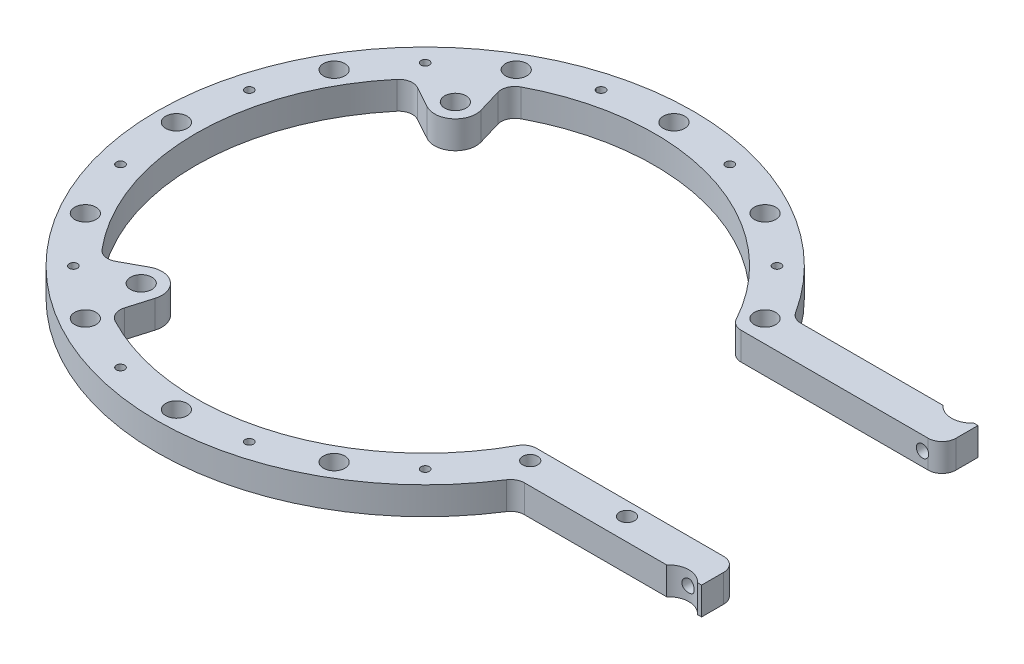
from build123d import *

# Parameters (mm, degrees)
BOSS_EXTRUDE1_DEPTH          = 6.35
SKETCH23_R                   = 4.7625
CUT_EXTRUDE2_DEPTH           = 114.608226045
F_10_0_1935_DIAMETER_HOLE1_D = 4.9149
F_10_0_1935_DIAMETER_HOLE2_D = 4.9149
F_4_40_TAPPED_HOLE1_D        = 1.905
CIRPATTERN1_COUNT            = 12
F_8_32_TAPPED_HOLE1_D        = 3.4544
F_4_40_TAPPED_HOLE2_D        = 2.8448


with BuildPart() as part:
    # Sketch1 → Boss-Extrude1 (new body)
    with BuildSketch(Plane(origin=(0, 0, 0), x_dir=(1, 0, 0), z_dir=(0, 1, 0))):
        with BuildLine():
            Line((95.25, -31.75), (54.547202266, -31.75))
            ThreePointArc((54.547202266, -31.75), (53.023228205, -32.139658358), (51.873319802, -33.212990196))
            ThreePointArc((51.873319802, -33.212990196), (-61.595, 0), (51.873319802, 33.212990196))
            ThreePointArc((51.873319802, 33.212990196), (53.023228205, 32.139658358), (54.547202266, 31.75))
            Line((54.547202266, 31.75), (95.25, 31.75))
            Line((95.25, 31.75), (95.25, 26.67))
            ThreePointArc((95.25, 26.67), (94.32006403, 24.42493597), (92.075, 23.495))
            Line((92.075, 23.495), (49.10484192, 23.495))
            ThreePointArc((49.10484192, 23.495), (47.481663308, 23.941279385), (46.314794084, 25.154659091))
            ThreePointArc((46.314794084, 25.154659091), (15.246366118, 50.451613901), (-24.632292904, 46.594711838))
            ThreePointArc((-24.632292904, 46.594711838), (-26.074225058, 45.02080141), (-26.193716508, 42.889584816))
            Line((-26.193716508, 42.889584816), (-24.584212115, 37.432751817))
            ThreePointArc((-24.584212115, 37.432751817), (-26.159314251, 32.380794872), (-31.429479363, 31.902699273))
            Line((-31.429479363, 31.902699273), (-36.426134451, 34.62317142))
            ThreePointArc((-36.426134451, 34.62317142), (-38.534859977, 34.954289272), (-40.37667936, 33.87537142))
            ThreePointArc((-40.37667936, 33.87537142), (-52.705, 0), (-40.37667936, -33.87537142))
            ThreePointArc((-40.37667936, -33.87537142), (-38.534859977, -34.954289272), (-36.426134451, -34.62317142))
            Line((-36.426134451, -34.62317142), (-31.429479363, -31.902699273))
            ThreePointArc((-31.429479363, -31.902699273), (-26.159314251, -32.380794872), (-24.584212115, -37.432751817))
            Line((-24.584212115, -37.432751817), (-26.193716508, -42.889584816))
            ThreePointArc((-26.193716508, -42.889584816), (-26.074225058, -45.02080141), (-24.632292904, -46.594711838))
            ThreePointArc((-24.632292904, -46.594711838), (-9.712044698, -51.802444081), (6.081346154, -52.352977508))
            ThreePointArc((6.081346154, -52.352977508), (29.517384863, -43.663955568), (46.314794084, -25.154659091))
            ThreePointArc((46.314794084, -25.154659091), (47.481663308, -23.941279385), (49.10484192, -23.495))
            Line((49.10484192, -23.495), (92.075, -23.495))
            ThreePointArc((92.075, -23.495), (94.32006403, -24.42493597), (95.25, -26.67))
            Line((95.25, -26.67), (95.25, -31.75))
        make_face()
    extrude(amount=BOSS_EXTRUDE1_DEPTH)

    # Sketch23 → Cut-Extrude2 (cut, through all)
    with BuildSketch(Plane(origin=(0, 6.35, 0), x_dir=(1, 0, 0), z_dir=(0, 1, 0))):
        with Locations((90.75326969, 34.925)):
            Circle(SKETCH23_R)
        with Locations((90.75326969, -34.925)):
            Circle(SKETCH23_R)
    extrude(amount=-CUT_EXTRUDE2_DEPTH, mode=Mode.SUBTRACT)

    # 10 _0.1935_ Diameter Hole1 (through all)
    with Locations(Plane(origin=(0, 6.35, 0), x_dir=(1, 0, 0), z_dir=(0, 1, 0))):
        with Locations((-29.152157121, -36.085426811), (-29.152157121, 36.085426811)):
            Hole(F_10_0_1935_DIAMETER_HOLE1_D / 2)

    # 10 _0.1935_ Diameter Hole2 (through all)
    with Locations(Plane(origin=(0, 0, 0), x_dir=(-1, 0, 0), z_dir=(0, -1, 0))):
        with Locations((57.15, 0)):
            f_10_0_1935_diameter_hole2 = Hole(F_10_0_1935_DIAMETER_HOLE2_D / 2)

    # 4-40 Tapped Hole1 (through all)
    with Locations(Plane(origin=(0, 6.35, 0), x_dir=(1, 0, 0), z_dir=(0, 1, 0))):
        with Locations((-55.202660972, -14.791508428)):
            f_4_40_tapped_hole1 = Hole(F_4_40_TAPPED_HOLE1_D / 2)

    # CirPattern1: 10 _0.1935_ Diameter Hole2, 4-40 Tapped Hole1 ×12 about axis, 2 skipped
    cirpattern1_axis = Axis((0, 0, 0), (0, -1, 0))
    add([f_10_0_1935_diameter_hole2.rotate(cirpattern1_axis, i * 360 / CIRPATTERN1_COUNT) for i in range(1, CIRPATTERN1_COUNT) if i not in (6, 7)], mode=Mode.SUBTRACT)
    add([f_4_40_tapped_hole1.rotate(cirpattern1_axis, i * 360 / CIRPATTERN1_COUNT) for i in range(1, CIRPATTERN1_COUNT) if i not in (6, 7)], mode=Mode.SUBTRACT)

    # 8-32 Tapped Hole1 (through all)
    with Locations(Plane(origin=(0, 0, 0), x_dir=(-1, 0, 0), z_dir=(0, -1, 0))):
        with Locations((-50.8, -26.67), (-73.025, -26.67)):
            Hole(F_8_32_TAPPED_HOLE1_D / 2)

    # 4-40 Tapped Hole2 (through all)
    with Locations(Plane.XY.offset(31.75)):
        with Locations((90.75326969, 3.175)):
            Hole(F_4_40_TAPPED_HOLE2_D / 2)


solid = part.part
